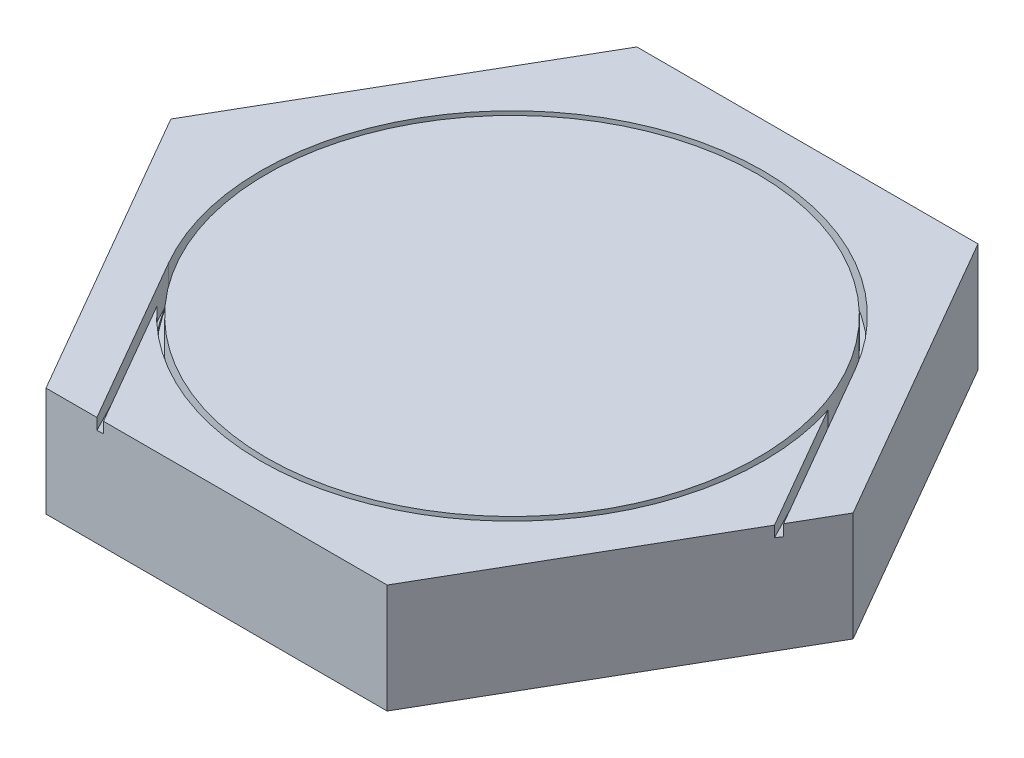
ISO-10303-21;
HEADER;
FILE_DESCRIPTION(('STEP AP214'),'2;1');
FILE_NAME('part.step','',(''),(''),'','','');
FILE_SCHEMA(('AUTOMOTIVE_DESIGN { 1 0 10303 214 1 1 1 1 }'));
ENDSEC;
DATA;
#1=APPLICATION_CONTEXT('core data for automotive mechanical design processes');
#2=APPLICATION_PROTOCOL_DEFINITION('international standard','automotive_design',2000,#1);
#3=PRODUCT_CONTEXT('',#1,'mechanical');
#4=PRODUCT('Part','Part','',(#3));
#5=PRODUCT_RELATED_PRODUCT_CATEGORY('part','',(#4));
#6=PRODUCT_DEFINITION_FORMATION('','',#4);
#7=PRODUCT_DEFINITION_CONTEXT('part definition',#1,'design');
#8=PRODUCT_DEFINITION('design','',#6,#7);
#9=PRODUCT_DEFINITION_SHAPE('','',#8);
#10=(LENGTH_UNIT() NAMED_UNIT(*) SI_UNIT(.MILLI.,.METRE.));
#11=(NAMED_UNIT(*) PLANE_ANGLE_UNIT() SI_UNIT($,.RADIAN.));
#12=(NAMED_UNIT(*) SI_UNIT($,.STERADIAN.) SOLID_ANGLE_UNIT());
#13=UNCERTAINTY_MEASURE_WITH_UNIT(LENGTH_MEASURE(1.E-05),#10,'distance_accuracy_value','');
#14=(GEOMETRIC_REPRESENTATION_CONTEXT(3) GLOBAL_UNCERTAINTY_ASSIGNED_CONTEXT((#13)) GLOBAL_UNIT_ASSIGNED_CONTEXT((#10,
#11,#12)) REPRESENTATION_CONTEXT('',''));
#15=CARTESIAN_POINT('',(0.,0.,0.));
#16=DIRECTION('',(0.,0.,1.));
#17=DIRECTION('',(1.,0.,0.));
#18=AXIS2_PLACEMENT_3D('',#15,#16,#17);
#19=CARTESIAN_POINT('',(0.,14.,0.));
#20=DIRECTION('',(0.,1.,0.));
#21=DIRECTION('',(0.,0.,1.));
#22=AXIS2_PLACEMENT_3D('',#19,#20,#21);
#23=CYLINDRICAL_SURFACE('',#22,46.05);
#24=CARTESIAN_POINT('',(0.,14.,0.));
#25=DIRECTION('',(0.,1.,0.));
#26=DIRECTION('',(0.,0.,1.));
#27=AXIS2_PLACEMENT_3D('',#24,#25,#26);
#28=CIRCLE('',#27,46.05);
#29=CARTESIAN_POINT('',(39.8804698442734,14.,-23.025));
#30=VERTEX_POINT('',#29);
#31=CARTESIAN_POINT('',(-39.8804698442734,14.,23.025));
#32=VERTEX_POINT('',#31);
#33=EDGE_CURVE('E164',#30,#32,#28,.T.);
#34=ORIENTED_EDGE('',*,*,#33,.F.);
#35=DIRECTION('',(0.,-1.,0.));
#36=VECTOR('',#35,1.);
#37=CARTESIAN_POINT('',(39.8804698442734,20.,-23.025));
#38=LINE('',#37,#36);
#39=CARTESIAN_POINT('',(39.8804698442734,20.,-23.025));
#40=VERTEX_POINT('',#39);
#41=EDGE_CURVE('E150',#40,#30,#38,.T.);
#42=ORIENTED_EDGE('',*,*,#41,.F.);
#43=CARTESIAN_POINT('',(0.,20.,0.));
#44=DIRECTION('',(0.,1.,0.));
#45=DIRECTION('',(0.,0.,1.));
#46=AXIS2_PLACEMENT_3D('',#43,#44,#45);
#47=CIRCLE('',#46,46.05);
#48=CARTESIAN_POINT('',(-39.8804698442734,20.,23.025));
#49=VERTEX_POINT('',#48);
#50=EDGE_CURVE('E162',#40,#49,#47,.T.);
#51=ORIENTED_EDGE('',*,*,#50,.T.);
#52=DIRECTION('',(0.,-1.,0.));
#53=VECTOR('',#52,1.);
#54=CARTESIAN_POINT('',(-39.8804698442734,20.,23.025));
#55=LINE('',#54,#53);
#56=EDGE_CURVE('E274',#49,#32,#55,.T.);
#57=ORIENTED_EDGE('',*,*,#56,.T.);
#58=EDGE_LOOP('',(#34,#42,#51,#57));
#59=FACE_BOUND('',#58,.T.);
#60=ADVANCED_FACE('F44',(#59),#23,.F.);
#61=CARTESIAN_POINT('',(0.,20.,0.));
#62=DIRECTION('',(0.,1.,0.));
#63=DIRECTION('',(0.,0.,1.));
#64=AXIS2_PLACEMENT_3D('',#61,#62,#63);
#65=PLANE('',#64);
#66=DIRECTION('',(0.5,0.,-0.866025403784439));
#67=VECTOR('',#66,1.);
#68=CARTESIAN_POINT('',(31.25,20.,54.1265877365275));
#69=LINE('',#68,#67);
#70=CARTESIAN_POINT('',(31.25,20.,54.1265877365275));
#71=VERTEX_POINT('',#70);
#72=CARTESIAN_POINT('',(57.2307621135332,20.,9.12658773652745));
#73=VERTEX_POINT('',#72);
#74=EDGE_CURVE('E183',#71,#73,#69,.T.);
#75=ORIENTED_EDGE('',*,*,#74,.T.);
#76=DIRECTION('',(-0.5,0.,-0.866025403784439));
#77=VECTOR('',#76,1.);
#78=CARTESIAN_POINT('',(57.2307621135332,20.,9.1265877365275));
#79=LINE('',#78,#77);
#80=CARTESIAN_POINT('',(43.8599697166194,20.,-14.0323040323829));
#81=VERTEX_POINT('',#80);
#82=EDGE_CURVE('E293',#73,#81,#79,.T.);
#83=ORIENTED_EDGE('',*,*,#82,.T.);
#84=CARTESIAN_POINT('',(-34.0823166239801,20.,30.9676959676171));
#85=VERTEX_POINT('',#84);
#86=EDGE_CURVE('E172',#85,#81,#47,.T.);
#87=ORIENTED_EDGE('',*,*,#86,.F.);
#88=DIRECTION('',(-0.5,0.,-0.866025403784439));
#89=VECTOR('',#88,1.);
#90=CARTESIAN_POINT('',(-20.7115242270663,20.,54.1265877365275));
#91=LINE('',#90,#89);
#92=CARTESIAN_POINT('',(-20.7115242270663,20.,54.1265877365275));
#93=VERTEX_POINT('',#92);
#94=EDGE_CURVE('E67',#93,#85,#91,.T.);
#95=ORIENTED_EDGE('',*,*,#94,.F.);
#96=DIRECTION('',(1.,0.,0.));
#97=VECTOR('',#96,1.);
#98=CARTESIAN_POINT('',(-31.25,20.,54.1265877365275));
#99=LINE('',#98,#97);
#100=EDGE_CURVE('E195',#93,#71,#99,.T.);
#101=ORIENTED_EDGE('',*,*,#100,.T.);
#102=EDGE_LOOP('',(#75,#83,#87,#95,#101));
#103=FACE_BOUND('',#102,.T.);
#104=ADVANCED_FACE('F305',(#103),#65,.T.);
#105=DIRECTION('',(0.,1.,0.));
#106=VECTOR('',#105,1.);
#107=CARTESIAN_POINT('',(43.8599697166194,14.,-14.032304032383));
#108=LINE('',#107,#106);
#109=CARTESIAN_POINT('',(43.8599697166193,15.0709591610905,-14.032304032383));
#110=VERTEX_POINT('',#109);
#111=EDGE_CURVE('E59',#110,#81,#108,.T.);
#112=ORIENTED_EDGE('',*,*,#111,.F.);
#113=CARTESIAN_POINT('',(0.,14.,0.));
#114=DIRECTION('',(0.0544400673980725,-0.99405488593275,0.0942929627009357));
#115=DIRECTION('',(0.497027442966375,0.108880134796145,0.860876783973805));
#116=AXIS2_PLACEMENT_3D('',#113,#114,#115);
#117=ELLIPSE('',#116,46.325409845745,46.05);
#118=EDGE_CURVE('E283',#110,#30,#117,.F.);
#119=ORIENTED_EDGE('',*,*,#118,.T.);
#120=EDGE_CURVE('E181',#32,#30,#28,.T.);
#121=ORIENTED_EDGE('',*,*,#120,.F.);
#122=CARTESIAN_POINT('',(0.,14.,0.));
#123=DIRECTION('',(-0.054440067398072,0.99405488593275,-0.0942929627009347));
#124=DIRECTION('',(0.497027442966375,0.108880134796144,0.860876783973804));
#125=AXIS2_PLACEMENT_3D('',#122,#123,#124);
#126=ELLIPSE('',#125,46.325409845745,46.05);
#127=CARTESIAN_POINT('',(-34.0823166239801,15.0709591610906,30.9676959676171));
#128=VERTEX_POINT('',#127);
#129=EDGE_CURVE('E264',#128,#32,#126,.F.);
#130=ORIENTED_EDGE('',*,*,#129,.F.);
#131=DIRECTION('',(0.,1.,0.));
#132=VECTOR('',#131,1.);
#133=CARTESIAN_POINT('',(-34.0823166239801,14.,30.9676959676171));
#134=LINE('',#133,#132);
#135=EDGE_CURVE('E271',#85,#128,#134,.F.);
#136=ORIENTED_EDGE('',*,*,#135,.F.);
#137=ORIENTED_EDGE('',*,*,#86,.T.);
#138=EDGE_LOOP('',(#112,#119,#121,#130,#136,#137));
#139=FACE_BOUND('',#138,.T.);
#140=ADVANCED_FACE('F300',(#139),#23,.F.);
#141=CARTESIAN_POINT('',(31.25,20.,54.1265877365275));
#142=DIRECTION('',(-0.866025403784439,0.,-0.5));
#143=DIRECTION('',(-0.5,0.,0.866025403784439));
#144=AXIS2_PLACEMENT_3D('',#141,#142,#143);
#145=PLANE('',#144);
#146=CARTESIAN_POINT('',(57.8369798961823,20.,8.07658773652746));
#147=VERTEX_POINT('',#146);
#148=CARTESIAN_POINT('',(62.5,20.,0.));
#149=VERTEX_POINT('',#148);
#150=EDGE_CURVE('E187',#147,#149,#69,.T.);
#151=ORIENTED_EDGE('',*,*,#150,.F.);
#152=DIRECTION('',(0.,-1.,0.));
#153=VECTOR('',#152,1.);
#154=CARTESIAN_POINT('',(57.8369798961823,20.,8.07658773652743));
#155=LINE('',#154,#153);
#156=CARTESIAN_POINT('',(57.8369798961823,17.9336001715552,8.07658773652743));
#157=VERTEX_POINT('',#156);
#158=EDGE_CURVE('E153',#147,#157,#155,.T.);
#159=ORIENTED_EDGE('',*,*,#158,.T.);
#160=DIRECTION('',(-0.4992518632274,0.05468371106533,0.864729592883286));
#161=VECTOR('',#160,1.);
#162=CARTESIAN_POINT('',(31.273088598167,20.8431780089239,54.0865971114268));
#163=LINE('',#162,#161);
#164=CARTESIAN_POINT('',(57.2307621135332,18.,9.12658773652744));
#165=VERTEX_POINT('',#164);
#166=EDGE_CURVE('E285',#157,#165,#163,.T.);
#167=ORIENTED_EDGE('',*,*,#166,.T.);
#168=DIRECTION('',(0.,-1.,0.));
#169=VECTOR('',#168,1.);
#170=CARTESIAN_POINT('',(57.2307621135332,20.,9.12658773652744));
#171=LINE('',#170,#169);
#172=EDGE_CURVE('E289',#73,#165,#171,.T.);
#173=ORIENTED_EDGE('',*,*,#172,.F.);
#174=ORIENTED_EDGE('',*,*,#74,.F.);
#175=DIRECTION('',(0.,-1.,0.));
#176=VECTOR('',#175,1.);
#177=CARTESIAN_POINT('',(31.25,20.,54.1265877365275));
#178=LINE('',#177,#176);
#179=CARTESIAN_POINT('',(31.25,0.,54.1265877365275));
#180=VERTEX_POINT('',#179);
#181=EDGE_CURVE('E198',#71,#180,#178,.T.);
#182=ORIENTED_EDGE('',*,*,#181,.T.);
#183=DIRECTION('',(0.5,0.,-0.866025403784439));
#184=VECTOR('',#183,1.);
#185=CARTESIAN_POINT('',(31.25,0.,54.1265877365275));
#186=LINE('',#185,#184);
#187=CARTESIAN_POINT('',(62.5,0.,0.));
#188=VERTEX_POINT('',#187);
#189=EDGE_CURVE('E199',#180,#188,#186,.T.);
#190=ORIENTED_EDGE('',*,*,#189,.T.);
#191=DIRECTION('',(0.,-1.,0.));
#192=VECTOR('',#191,1.);
#193=CARTESIAN_POINT('',(62.5,20.,0.));
#194=LINE('',#193,#192);
#195=EDGE_CURVE('E13',#149,#188,#194,.T.);
#196=ORIENTED_EDGE('',*,*,#195,.F.);
#197=EDGE_LOOP('',(#151,#159,#167,#173,#174,#182,#190,#196));
#198=FACE_BOUND('',#197,.T.);
#199=ADVANCED_FACE('F46',(#198),#145,.F.);
#200=CARTESIAN_POINT('',(62.5,20.,0.));
#201=DIRECTION('',(-0.866025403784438,0.,0.5));
#202=DIRECTION('',(0.5,0.,0.866025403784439));
#203=AXIS2_PLACEMENT_3D('',#200,#201,#202);
#204=PLANE('',#203);
#205=DIRECTION('',(-0.5,0.,-0.866025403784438));
#206=VECTOR('',#205,1.);
#207=CARTESIAN_POINT('',(62.5,0.,0.));
#208=LINE('',#207,#206);
#209=CARTESIAN_POINT('',(31.25,0.,-54.1265877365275));
#210=VERTEX_POINT('',#209);
#211=EDGE_CURVE('E202',#188,#210,#208,.T.);
#212=ORIENTED_EDGE('',*,*,#211,.T.);
#213=DIRECTION('',(0.,-1.,0.));
#214=VECTOR('',#213,1.);
#215=CARTESIAN_POINT('',(31.25,20.,-54.1265877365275));
#216=LINE('',#215,#214);
#217=CARTESIAN_POINT('',(31.25,20.,-54.1265877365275));
#218=VERTEX_POINT('',#217);
#219=EDGE_CURVE('E52',#218,#210,#216,.T.);
#220=ORIENTED_EDGE('',*,*,#219,.F.);
#221=DIRECTION('',(-0.5,0.,-0.866025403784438));
#222=VECTOR('',#221,1.);
#223=CARTESIAN_POINT('',(62.5,20.,0.));
#224=LINE('',#223,#222);
#225=EDGE_CURVE('E186',#149,#218,#224,.T.);
#226=ORIENTED_EDGE('',*,*,#225,.F.);
#227=ORIENTED_EDGE('',*,*,#195,.T.);
#228=EDGE_LOOP('',(#212,#220,#226,#227));
#229=FACE_BOUND('',#228,.T.);
#230=ADVANCED_FACE('F247',(#229),#204,.F.);
#231=CARTESIAN_POINT('',(31.25,20.,-54.1265877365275));
#232=DIRECTION('',(0.,0.,1.));
#233=DIRECTION('',(1.,0.,0.));
#234=AXIS2_PLACEMENT_3D('',#231,#232,#233);
#235=PLANE('',#234);
#236=DIRECTION('',(-1.,0.,0.));
#237=VECTOR('',#236,1.);
#238=CARTESIAN_POINT('',(31.25,0.,-54.1265877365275));
#239=LINE('',#238,#237);
#240=CARTESIAN_POINT('',(-31.25,0.,-54.1265877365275));
#241=VERTEX_POINT('',#240);
#242=EDGE_CURVE('E204',#210,#241,#239,.T.);
#243=ORIENTED_EDGE('',*,*,#242,.T.);
#244=DIRECTION('',(0.,-1.,0.));
#245=VECTOR('',#244,1.);
#246=CARTESIAN_POINT('',(-31.25,20.,-54.1265877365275));
#247=LINE('',#246,#245);
#248=CARTESIAN_POINT('',(-31.25,20.,-54.1265877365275));
#249=VERTEX_POINT('',#248);
#250=EDGE_CURVE('E220',#249,#241,#247,.T.);
#251=ORIENTED_EDGE('',*,*,#250,.F.);
#252=DIRECTION('',(-1.,0.,0.));
#253=VECTOR('',#252,1.);
#254=CARTESIAN_POINT('',(31.25,20.,-54.1265877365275));
#255=LINE('',#254,#253);
#256=EDGE_CURVE('E189',#218,#249,#255,.T.);
#257=ORIENTED_EDGE('',*,*,#256,.F.);
#258=ORIENTED_EDGE('',*,*,#219,.T.);
#259=EDGE_LOOP('',(#243,#251,#257,#258));
#260=FACE_BOUND('',#259,.T.);
#261=ADVANCED_FACE('F227',(#260),#235,.F.);
#262=CARTESIAN_POINT('',(-31.25,20.,-54.1265877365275));
#263=DIRECTION('',(0.866025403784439,0.,0.5));
#264=DIRECTION('',(0.5,0.,-0.866025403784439));
#265=AXIS2_PLACEMENT_3D('',#262,#263,#264);
#266=PLANE('',#265);
#267=DIRECTION('',(-0.5,0.,0.866025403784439));
#268=VECTOR('',#267,1.);
#269=CARTESIAN_POINT('',(-31.25,0.,-54.1265877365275));
#270=LINE('',#269,#268);
#271=CARTESIAN_POINT('',(-62.5000000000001,0.,0.));
#272=VERTEX_POINT('',#271);
#273=EDGE_CURVE('E206',#241,#272,#270,.T.);
#274=ORIENTED_EDGE('',*,*,#273,.T.);
#275=DIRECTION('',(0.,-1.,0.));
#276=VECTOR('',#275,1.);
#277=CARTESIAN_POINT('',(-62.5000000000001,20.,0.));
#278=LINE('',#277,#276);
#279=CARTESIAN_POINT('',(-62.5000000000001,20.,0.));
#280=VERTEX_POINT('',#279);
#281=EDGE_CURVE('E217',#280,#272,#278,.T.);
#282=ORIENTED_EDGE('',*,*,#281,.F.);
#283=DIRECTION('',(-0.5,0.,0.866025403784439));
#284=VECTOR('',#283,1.);
#285=CARTESIAN_POINT('',(-31.25,20.,-54.1265877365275));
#286=LINE('',#285,#284);
#287=EDGE_CURVE('E191',#249,#280,#286,.T.);
#288=ORIENTED_EDGE('',*,*,#287,.F.);
#289=ORIENTED_EDGE('',*,*,#250,.T.);
#290=EDGE_LOOP('',(#274,#282,#288,#289));
#291=FACE_BOUND('',#290,.T.);
#292=ADVANCED_FACE('F239',(#291),#266,.F.);
#293=CARTESIAN_POINT('',(-62.5000000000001,20.,0.));
#294=DIRECTION('',(0.866025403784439,0.,-0.5));
#295=DIRECTION('',(-0.5,0.,-0.866025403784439));
#296=AXIS2_PLACEMENT_3D('',#293,#294,#295);
#297=PLANE('',#296);
#298=DIRECTION('',(0.5,0.,0.866025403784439));
#299=VECTOR('',#298,1.);
#300=CARTESIAN_POINT('',(-62.5000000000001,0.,0.));
#301=LINE('',#300,#299);
#302=CARTESIAN_POINT('',(-31.25,0.,54.1265877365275));
#303=VERTEX_POINT('',#302);
#304=EDGE_CURVE('E208',#272,#303,#301,.T.);
#305=ORIENTED_EDGE('',*,*,#304,.T.);
#306=DIRECTION('',(0.,-1.,0.));
#307=VECTOR('',#306,1.);
#308=CARTESIAN_POINT('',(-31.25,20.,54.1265877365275));
#309=LINE('',#308,#307);
#310=CARTESIAN_POINT('',(-31.25,20.,54.1265877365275));
#311=VERTEX_POINT('',#310);
#312=EDGE_CURVE('E214',#311,#303,#309,.T.);
#313=ORIENTED_EDGE('',*,*,#312,.F.);
#314=DIRECTION('',(0.5,0.,0.866025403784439));
#315=VECTOR('',#314,1.);
#316=CARTESIAN_POINT('',(-62.5000000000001,20.,0.));
#317=LINE('',#316,#315);
#318=EDGE_CURVE('E193',#280,#311,#317,.T.);
#319=ORIENTED_EDGE('',*,*,#318,.F.);
#320=ORIENTED_EDGE('',*,*,#281,.T.);
#321=EDGE_LOOP('',(#305,#313,#319,#320));
#322=FACE_BOUND('',#321,.T.);
#323=ADVANCED_FACE('F243',(#322),#297,.F.);
#324=CARTESIAN_POINT('',(-31.25,20.,54.1265877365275));
#325=DIRECTION('',(0.,0.,-1.));
#326=DIRECTION('',(-1.,0.,0.));
#327=AXIS2_PLACEMENT_3D('',#324,#325,#326);
#328=PLANE('',#327);
#329=DIRECTION('',(0.998503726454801,0.0546837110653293,0.));
#330=VECTOR('',#329,1.);
#331=CARTESIAN_POINT('',(-31.1092829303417,17.4305599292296,54.1265877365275));
#332=LINE('',#331,#330);
#333=CARTESIAN_POINT('',(-21.9239597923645,17.9336001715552,54.1265877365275));
#334=VERTEX_POINT('',#333);
#335=CARTESIAN_POINT('',(-20.7115242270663,18.,54.1265877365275));
#336=VERTEX_POINT('',#335);
#337=EDGE_CURVE('E258',#334,#336,#332,.T.);
#338=ORIENTED_EDGE('',*,*,#337,.F.);
#339=DIRECTION('',(0.,1.,0.));
#340=VECTOR('',#339,1.);
#341=CARTESIAN_POINT('',(-21.9239597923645,20.,54.1265877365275));
#342=LINE('',#341,#340);
#343=CARTESIAN_POINT('',(-21.9239597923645,20.,54.1265877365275));
#344=VERTEX_POINT('',#343);
#345=EDGE_CURVE('E256',#334,#344,#342,.T.);
#346=ORIENTED_EDGE('',*,*,#345,.T.);
#347=EDGE_CURVE('E196',#311,#344,#99,.T.);
#348=ORIENTED_EDGE('',*,*,#347,.F.);
#349=ORIENTED_EDGE('',*,*,#312,.T.);
#350=DIRECTION('',(1.,0.,0.));
#351=VECTOR('',#350,1.);
#352=CARTESIAN_POINT('',(-31.25,0.,54.1265877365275));
#353=LINE('',#352,#351);
#354=EDGE_CURVE('E210',#303,#180,#353,.T.);
#355=ORIENTED_EDGE('',*,*,#354,.T.);
#356=ORIENTED_EDGE('',*,*,#181,.F.);
#357=ORIENTED_EDGE('',*,*,#100,.F.);
#358=DIRECTION('',(0.,1.,0.));
#359=VECTOR('',#358,1.);
#360=CARTESIAN_POINT('',(-20.7115242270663,20.,54.1265877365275));
#361=LINE('',#360,#359);
#362=EDGE_CURVE('E269',#336,#93,#361,.T.);
#363=ORIENTED_EDGE('',*,*,#362,.F.);
#364=EDGE_LOOP('',(#338,#346,#348,#349,#355,#356,#357,#363));
#365=FACE_BOUND('',#364,.T.);
#366=ADVANCED_FACE('F253',(#365),#328,.F.);
#367=DIRECTION('',(-0.5,0.,-0.866025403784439));
#368=VECTOR('',#367,1.);
#369=CARTESIAN_POINT('',(58.1400887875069,20.,8.6015877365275));
#370=LINE('',#369,#368);
#371=EDGE_CURVE('E146',#147,#40,#370,.T.);
#372=ORIENTED_EDGE('',*,*,#371,.F.);
#373=ORIENTED_EDGE('',*,*,#150,.T.);
#374=ORIENTED_EDGE('',*,*,#225,.T.);
#375=ORIENTED_EDGE('',*,*,#256,.T.);
#376=ORIENTED_EDGE('',*,*,#287,.T.);
#377=ORIENTED_EDGE('',*,*,#318,.T.);
#378=ORIENTED_EDGE('',*,*,#347,.T.);
#379=DIRECTION('',(-0.5,0.,-0.866025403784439));
#380=VECTOR('',#379,1.);
#381=CARTESIAN_POINT('',(-21.6208509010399,20.,54.6515877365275));
#382=LINE('',#381,#380);
#383=EDGE_CURVE('E171',#344,#49,#382,.T.);
#384=ORIENTED_EDGE('',*,*,#383,.T.);
#385=ORIENTED_EDGE('',*,*,#50,.F.);
#386=EDGE_LOOP('',(#372,#373,#374,#375,#376,#377,#378,#384,#385));
#387=FACE_BOUND('',#386,.T.);
#388=ADVANCED_FACE('F169',(#387),#65,.T.);
#389=CARTESIAN_POINT('',(0.,0.,0.));
#390=DIRECTION('',(0.,1.,0.));
#391=DIRECTION('',(0.,0.,1.));
#392=AXIS2_PLACEMENT_3D('',#389,#390,#391);
#393=PLANE('',#392);
#394=ORIENTED_EDGE('',*,*,#189,.F.);
#395=ORIENTED_EDGE('',*,*,#354,.F.);
#396=ORIENTED_EDGE('',*,*,#304,.F.);
#397=ORIENTED_EDGE('',*,*,#273,.F.);
#398=ORIENTED_EDGE('',*,*,#242,.F.);
#399=ORIENTED_EDGE('',*,*,#211,.F.);
#400=EDGE_LOOP('',(#394,#395,#396,#397,#398,#399));
#401=FACE_BOUND('',#400,.T.);
#402=ADVANCED_FACE('F234',(#401),#393,.F.);
#403=CARTESIAN_POINT('',(0.,14.,0.));
#404=DIRECTION('',(0.,1.,0.));
#405=DIRECTION('',(0.,0.,1.));
#406=AXIS2_PLACEMENT_3D('',#403,#404,#405);
#407=PLANE('',#406);
#408=ORIENTED_EDGE('',*,*,#120,.T.);
#409=ORIENTED_EDGE('',*,*,#33,.T.);
#410=EDGE_LOOP('',(#408,#409));
#411=FACE_BOUND('',#410,.T.);
#412=CARTESIAN_POINT('',(0.,14.,0.));
#413=DIRECTION('',(0.,1.,0.));
#414=DIRECTION('',(0.,0.,1.));
#415=AXIS2_PLACEMENT_3D('',#412,#413,#414);
#416=CIRCLE('',#415,45.);
#417=CARTESIAN_POINT('',(0.,14.,45.));
#418=VERTEX_POINT('',#417);
#419=EDGE_CURVE('E173',#418,#418,#416,.T.);
#420=ORIENTED_EDGE('',*,*,#419,.F.);
#421=EDGE_LOOP('',(#420));
#422=FACE_BOUND('',#421,.T.);
#423=ADVANCED_FACE('F311',(#411,#422),#407,.T.);
#424=CARTESIAN_POINT('',(0.,14.,0.));
#425=DIRECTION('',(0.,1.,0.));
#426=DIRECTION('',(0.,0.,1.));
#427=AXIS2_PLACEMENT_3D('',#424,#425,#426);
#428=CYLINDRICAL_SURFACE('',#427,45.);
#429=ORIENTED_EDGE('',*,*,#419,.T.);
#430=EDGE_LOOP('',(#429));
#431=FACE_BOUND('',#430,.T.);
#432=CARTESIAN_POINT('',(0.,20.,0.));
#433=DIRECTION('',(0.,1.,0.));
#434=DIRECTION('',(0.,0.,1.));
#435=AXIS2_PLACEMENT_3D('',#432,#433,#434);
#436=CIRCLE('',#435,45.);
#437=CARTESIAN_POINT('',(0.,20.,45.));
#438=VERTEX_POINT('',#437);
#439=EDGE_CURVE('E177',#438,#438,#436,.T.);
#440=ORIENTED_EDGE('',*,*,#439,.F.);
#441=EDGE_LOOP('',(#440));
#442=FACE_BOUND('',#441,.T.);
#443=ADVANCED_FACE('F314',(#431,#442),#428,.T.);
#444=ORIENTED_EDGE('',*,*,#439,.T.);
#445=EDGE_LOOP('',(#444));
#446=FACE_BOUND('',#445,.T.);
#447=ADVANCED_FACE('F320',(#446),#65,.T.);
#448=CARTESIAN_POINT('',(-39.8804698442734,0.,23.025));
#449=DIRECTION('',(-0.866025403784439,0.,0.5));
#450=DIRECTION('',(0.5,0.,0.866025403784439));
#451=AXIS2_PLACEMENT_3D('',#448,#449,#450);
#452=PLANE('',#451);
#453=DIRECTION('',(0.497027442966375,0.108880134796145,0.860876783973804));
#454=VECTOR('',#453,1.);
#455=CARTESIAN_POINT('',(-39.8804698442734,14.,23.025));
#456=LINE('',#455,#454);
#457=EDGE_CURVE('E279',#32,#334,#456,.T.);
#458=ORIENTED_EDGE('',*,*,#457,.F.);
#459=ORIENTED_EDGE('',*,*,#56,.F.);
#460=ORIENTED_EDGE('',*,*,#383,.F.);
#461=ORIENTED_EDGE('',*,*,#345,.F.);
#462=EDGE_LOOP('',(#458,#459,#460,#461));
#463=FACE_BOUND('',#462,.T.);
#464=ADVANCED_FACE('F325',(#463),#452,.F.);
#465=CARTESIAN_POINT('',(-21.6208509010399,18.,54.6515877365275));
#466=DIRECTION('',(-0.054440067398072,0.99405488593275,-0.0942929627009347));
#467=DIRECTION('',(0.,0.0944330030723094,0.995531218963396));
#468=AXIS2_PLACEMENT_3D('',#465,#466,#467);
#469=PLANE('',#468);
#470=ORIENTED_EDGE('',*,*,#337,.T.);
#471=DIRECTION('',(0.497027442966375,0.108880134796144,0.860876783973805));
#472=VECTOR('',#471,1.);
#473=CARTESIAN_POINT('',(-20.7115242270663,18.,54.1265877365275));
#474=LINE('',#473,#472);
#475=EDGE_CURVE('E275',#128,#336,#474,.T.);
#476=ORIENTED_EDGE('',*,*,#475,.F.);
#477=ORIENTED_EDGE('',*,*,#129,.T.);
#478=ORIENTED_EDGE('',*,*,#457,.T.);
#479=EDGE_LOOP('',(#470,#476,#477,#478));
#480=FACE_BOUND('',#479,.T.);
#481=ADVANCED_FACE('F309',(#480),#469,.T.);
#482=CARTESIAN_POINT('',(-38.9711431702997,0.,22.5));
#483=DIRECTION('',(-0.866025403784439,0.,0.5));
#484=DIRECTION('',(0.5,0.,0.866025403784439));
#485=AXIS2_PLACEMENT_3D('',#482,#483,#484);
#486=PLANE('',#485);
#487=ORIENTED_EDGE('',*,*,#362,.T.);
#488=ORIENTED_EDGE('',*,*,#94,.T.);
#489=ORIENTED_EDGE('',*,*,#135,.T.);
#490=ORIENTED_EDGE('',*,*,#475,.T.);
#491=EDGE_LOOP('',(#487,#488,#489,#490));
#492=FACE_BOUND('',#491,.T.);
#493=ADVANCED_FACE('F306',(#492),#486,.T.);
#494=CARTESIAN_POINT('',(39.8804698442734,0.,-23.025));
#495=DIRECTION('',(0.866025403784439,0.,-0.5));
#496=DIRECTION('',(0.5,0.,0.866025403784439));
#497=AXIS2_PLACEMENT_3D('',#494,#495,#496);
#498=PLANE('',#497);
#499=ORIENTED_EDGE('',*,*,#371,.T.);
#500=ORIENTED_EDGE('',*,*,#41,.T.);
#501=DIRECTION('',(0.497027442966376,0.108880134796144,0.860876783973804));
#502=VECTOR('',#501,1.);
#503=CARTESIAN_POINT('',(58.1400887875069,18.,8.6015877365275));
#504=LINE('',#503,#502);
#505=EDGE_CURVE('E157',#30,#157,#504,.T.);
#506=ORIENTED_EDGE('',*,*,#505,.T.);
#507=ORIENTED_EDGE('',*,*,#158,.F.);
#508=EDGE_LOOP('',(#499,#500,#506,#507));
#509=FACE_BOUND('',#508,.T.);
#510=ADVANCED_FACE('F148',(#509),#498,.F.);
#511=CARTESIAN_POINT('',(39.8804698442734,14.,-23.025));
#512=DIRECTION('',(0.0544400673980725,-0.99405488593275,0.0942929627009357));
#513=DIRECTION('',(0.,-0.0944330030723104,-0.995531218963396));
#514=AXIS2_PLACEMENT_3D('',#511,#512,#513);
#515=PLANE('',#514);
#516=DIRECTION('',(0.497027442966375,0.108880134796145,0.860876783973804));
#517=VECTOR('',#516,1.);
#518=CARTESIAN_POINT('',(38.9711431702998,14.,-22.5));
#519=LINE('',#518,#517);
#520=EDGE_CURVE('E166',#110,#165,#519,.T.);
#521=ORIENTED_EDGE('',*,*,#520,.T.);
#522=ORIENTED_EDGE('',*,*,#166,.F.);
#523=ORIENTED_EDGE('',*,*,#505,.F.);
#524=ORIENTED_EDGE('',*,*,#118,.F.);
#525=EDGE_LOOP('',(#521,#522,#523,#524));
#526=FACE_BOUND('',#525,.T.);
#527=ADVANCED_FACE('F297',(#526),#515,.F.);
#528=CARTESIAN_POINT('',(38.9711431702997,0.,-22.5));
#529=DIRECTION('',(0.866025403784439,0.,-0.5));
#530=DIRECTION('',(0.5,0.,0.866025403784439));
#531=AXIS2_PLACEMENT_3D('',#528,#529,#530);
#532=PLANE('',#531);
#533=ORIENTED_EDGE('',*,*,#111,.T.);
#534=ORIENTED_EDGE('',*,*,#82,.F.);
#535=ORIENTED_EDGE('',*,*,#172,.T.);
#536=ORIENTED_EDGE('',*,*,#520,.F.);
#537=EDGE_LOOP('',(#533,#534,#535,#536));
#538=FACE_BOUND('',#537,.T.);
#539=ADVANCED_FACE('F298',(#538),#532,.T.);
#540=CLOSED_SHELL('',(#60,#104,#140,#199,#230,#261,#292,#323,#366,#388,#402,#423,#443,#447,#464,
#481,#493,#510,#527,#539));
#541=MANIFOLD_SOLID_BREP('B2',#540);
#542=ADVANCED_BREP_SHAPE_REPRESENTATION('',(#18,#541),#14);
#543=SHAPE_DEFINITION_REPRESENTATION(#9,#542);
ENDSEC;
END-ISO-10303-21;
